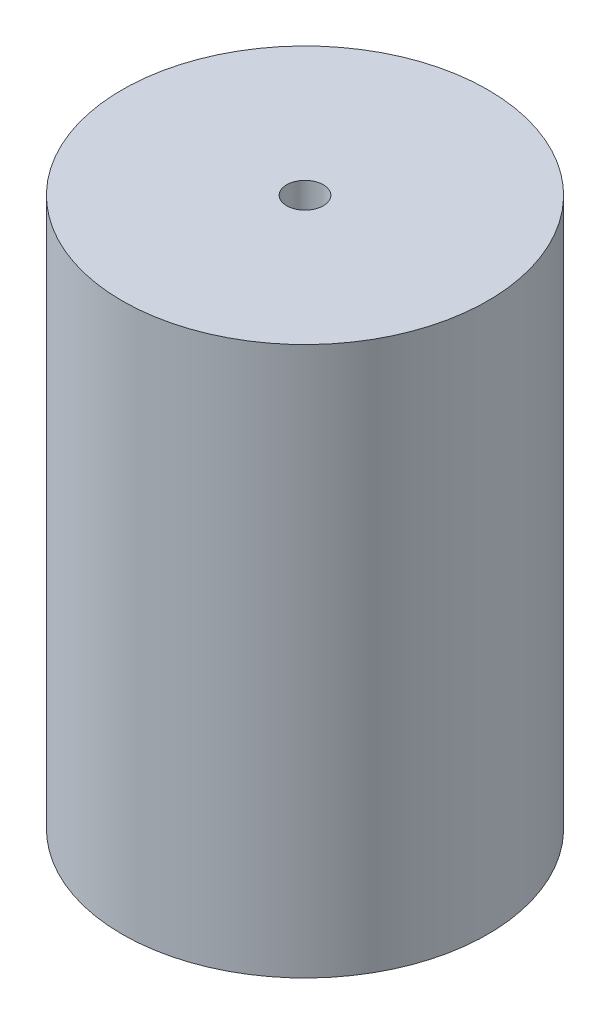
ISO-10303-21;
HEADER;
FILE_DESCRIPTION(('STEP AP214'),'2;1');
FILE_NAME('part.step','',(''),(''),'','','');
FILE_SCHEMA(('AUTOMOTIVE_DESIGN { 1 0 10303 214 1 1 1 1 }'));
ENDSEC;
DATA;
#1=APPLICATION_CONTEXT('core data for automotive mechanical design processes');
#2=APPLICATION_PROTOCOL_DEFINITION('international standard','automotive_design',2000,#1);
#3=PRODUCT_CONTEXT('',#1,'mechanical');
#4=PRODUCT('Part','Part','',(#3));
#5=PRODUCT_RELATED_PRODUCT_CATEGORY('part','',(#4));
#6=PRODUCT_DEFINITION_FORMATION('','',#4);
#7=PRODUCT_DEFINITION_CONTEXT('part definition',#1,'design');
#8=PRODUCT_DEFINITION('design','',#6,#7);
#9=PRODUCT_DEFINITION_SHAPE('','',#8);
#10=(LENGTH_UNIT() NAMED_UNIT(*) SI_UNIT(.MILLI.,.METRE.));
#11=(NAMED_UNIT(*) PLANE_ANGLE_UNIT() SI_UNIT($,.RADIAN.));
#12=(NAMED_UNIT(*) SI_UNIT($,.STERADIAN.) SOLID_ANGLE_UNIT());
#13=UNCERTAINTY_MEASURE_WITH_UNIT(LENGTH_MEASURE(1.E-05),#10,'distance_accuracy_value','');
#14=(GEOMETRIC_REPRESENTATION_CONTEXT(3) GLOBAL_UNCERTAINTY_ASSIGNED_CONTEXT((#13)) GLOBAL_UNIT_ASSIGNED_CONTEXT((#10,
#11,#12)) REPRESENTATION_CONTEXT('',''));
#15=CARTESIAN_POINT('',(0.,0.,0.));
#16=DIRECTION('',(0.,0.,1.));
#17=DIRECTION('',(1.,0.,0.));
#18=AXIS2_PLACEMENT_3D('',#15,#16,#17);
#19=CARTESIAN_POINT('',(0.,95.25,0.));
#20=DIRECTION('',(0.,1.,0.));
#21=DIRECTION('',(0.,0.,1.));
#22=AXIS2_PLACEMENT_3D('',#19,#20,#21);
#23=PLANE('',#22);
#24=CARTESIAN_POINT('',(0.,95.25,0.));
#25=DIRECTION('',(0.,1.,0.));
#26=DIRECTION('',(0.,0.,1.));
#27=AXIS2_PLACEMENT_3D('',#24,#25,#26);
#28=CIRCLE('',#27,31.75);
#29=CARTESIAN_POINT('',(0.,95.25,31.75));
#30=VERTEX_POINT('',#29);
#31=EDGE_CURVE('E10',#30,#30,#28,.T.);
#32=ORIENTED_EDGE('',*,*,#31,.T.);
#33=EDGE_LOOP('',(#32));
#34=FACE_BOUND('',#33,.T.);
#35=CARTESIAN_POINT('',(0.,95.25,0.));
#36=DIRECTION('',(0.,1.,0.));
#37=DIRECTION('',(0.,0.,1.));
#38=AXIS2_PLACEMENT_3D('',#35,#36,#37);
#39=CIRCLE('',#38,3.175);
#40=CARTESIAN_POINT('',(0.,95.25,3.175));
#41=VERTEX_POINT('',#40);
#42=EDGE_CURVE('E50',#41,#41,#39,.T.);
#43=ORIENTED_EDGE('',*,*,#42,.F.);
#44=EDGE_LOOP('',(#43));
#45=FACE_BOUND('',#44,.T.);
#46=ADVANCED_FACE('F37',(#34,#45),#23,.T.);
#47=CARTESIAN_POINT('',(0.,0.,0.));
#48=DIRECTION('',(0.,1.,0.));
#49=DIRECTION('',(0.,0.,1.));
#50=AXIS2_PLACEMENT_3D('',#47,#48,#49);
#51=PLANE('',#50);
#52=CARTESIAN_POINT('',(0.,0.,0.));
#53=DIRECTION('',(0.,1.,0.));
#54=DIRECTION('',(0.,0.,1.));
#55=AXIS2_PLACEMENT_3D('',#52,#53,#54);
#56=CIRCLE('',#55,31.75);
#57=CARTESIAN_POINT('',(0.,0.,31.75));
#58=VERTEX_POINT('',#57);
#59=EDGE_CURVE('E41',#58,#58,#56,.T.);
#60=ORIENTED_EDGE('',*,*,#59,.F.);
#61=EDGE_LOOP('',(#60));
#62=FACE_BOUND('',#61,.T.);
#63=CARTESIAN_POINT('',(0.,0.,0.));
#64=DIRECTION('',(0.,1.,0.));
#65=DIRECTION('',(0.,0.,1.));
#66=AXIS2_PLACEMENT_3D('',#63,#64,#65);
#67=CIRCLE('',#66,3.175);
#68=CARTESIAN_POINT('',(0.,0.,3.175));
#69=VERTEX_POINT('',#68);
#70=EDGE_CURVE('E52',#69,#69,#67,.T.);
#71=ORIENTED_EDGE('',*,*,#70,.T.);
#72=EDGE_LOOP('',(#71));
#73=FACE_BOUND('',#72,.T.);
#74=ADVANCED_FACE('F64',(#62,#73),#51,.F.);
#75=CARTESIAN_POINT('',(0.,95.25,0.));
#76=DIRECTION('',(0.,-1.,0.));
#77=DIRECTION('',(0.,0.,-1.));
#78=AXIS2_PLACEMENT_3D('',#75,#76,#77);
#79=CYLINDRICAL_SURFACE('',#78,31.75);
#80=ORIENTED_EDGE('',*,*,#31,.F.);
#81=EDGE_LOOP('',(#80));
#82=FACE_BOUND('',#81,.T.);
#83=ORIENTED_EDGE('',*,*,#59,.T.);
#84=EDGE_LOOP('',(#83));
#85=FACE_BOUND('',#84,.T.);
#86=ADVANCED_FACE('F39',(#82,#85),#79,.T.);
#87=CARTESIAN_POINT('',(0.,95.25,0.));
#88=DIRECTION('',(0.,-1.,0.));
#89=DIRECTION('',(0.,0.,-1.));
#90=AXIS2_PLACEMENT_3D('',#87,#88,#89);
#91=CYLINDRICAL_SURFACE('',#90,3.175);
#92=ORIENTED_EDGE('',*,*,#42,.T.);
#93=EDGE_LOOP('',(#92));
#94=FACE_BOUND('',#93,.T.);
#95=ORIENTED_EDGE('',*,*,#70,.F.);
#96=EDGE_LOOP('',(#95));
#97=FACE_BOUND('',#96,.T.);
#98=ADVANCED_FACE('F60',(#94,#97),#91,.F.);
#99=CLOSED_SHELL('',(#46,#74,#86,#98));
#100=MANIFOLD_SOLID_BREP('B2',#99);
#101=ADVANCED_BREP_SHAPE_REPRESENTATION('',(#18,#100),#14);
#102=SHAPE_DEFINITION_REPRESENTATION(#9,#101);
ENDSEC;
END-ISO-10303-21;
